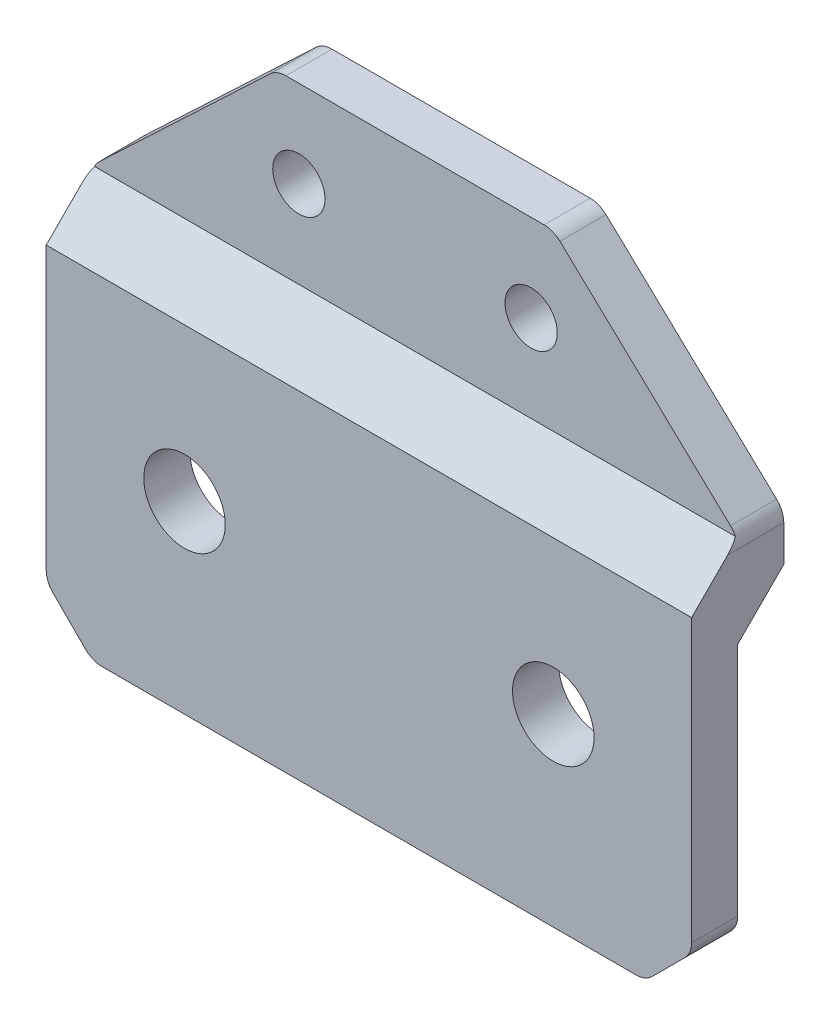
ISO-10303-21;
HEADER;
FILE_DESCRIPTION(('STEP AP214'),'2;1');
FILE_NAME('part.step','',(''),(''),'','','');
FILE_SCHEMA(('AUTOMOTIVE_DESIGN { 1 0 10303 214 1 1 1 1 }'));
ENDSEC;
DATA;
#1=APPLICATION_CONTEXT('core data for automotive mechanical design processes');
#2=APPLICATION_PROTOCOL_DEFINITION('international standard','automotive_design',2000,#1);
#3=PRODUCT_CONTEXT('',#1,'mechanical');
#4=PRODUCT('Part','Part','',(#3));
#5=PRODUCT_RELATED_PRODUCT_CATEGORY('part','',(#4));
#6=PRODUCT_DEFINITION_FORMATION('','',#4);
#7=PRODUCT_DEFINITION_CONTEXT('part definition',#1,'design');
#8=PRODUCT_DEFINITION('design','',#6,#7);
#9=PRODUCT_DEFINITION_SHAPE('','',#8);
#10=(LENGTH_UNIT() NAMED_UNIT(*) SI_UNIT(.MILLI.,.METRE.));
#11=(NAMED_UNIT(*) PLANE_ANGLE_UNIT() SI_UNIT($,.RADIAN.));
#12=(NAMED_UNIT(*) SI_UNIT($,.STERADIAN.) SOLID_ANGLE_UNIT());
#13=UNCERTAINTY_MEASURE_WITH_UNIT(LENGTH_MEASURE(1.E-05),#10,'distance_accuracy_value','');
#14=(GEOMETRIC_REPRESENTATION_CONTEXT(3) GLOBAL_UNCERTAINTY_ASSIGNED_CONTEXT((#13)) GLOBAL_UNIT_ASSIGNED_CONTEXT((#10,
#11,#12)) REPRESENTATION_CONTEXT('',''));
#15=CARTESIAN_POINT('',(0.,0.,0.));
#16=DIRECTION('',(0.,0.,1.));
#17=DIRECTION('',(1.,0.,0.));
#18=AXIS2_PLACEMENT_3D('',#15,#16,#17);
#19=CARTESIAN_POINT('',(22.225,13.7,3.175));
#20=DIRECTION('',(-1.,0.,0.));
#21=DIRECTION('',(0.,0.,1.));
#22=AXIS2_PLACEMENT_3D('',#19,#20,#21);
#23=PLANE('',#22);
#24=DIRECTION('',(0.,-1.,0.));
#25=VECTOR('',#24,1.);
#26=CARTESIAN_POINT('',(22.225,13.7,-3.175));
#27=LINE('',#26,#25);
#28=CARTESIAN_POINT('',(22.225,13.0159312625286,-3.175));
#29=VERTEX_POINT('',#28);
#30=CARTESIAN_POINT('',(22.225,10.5249999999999,-3.175));
#31=VERTEX_POINT('',#30);
#32=EDGE_CURVE('E183',#29,#31,#27,.T.);
#33=ORIENTED_EDGE('',*,*,#32,.F.);
#34=DIRECTION('',(0.,0.,-1.));
#35=VECTOR('',#34,1.);
#36=CARTESIAN_POINT('',(22.225,13.0159312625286,3.175));
#37=LINE('',#36,#35);
#38=CARTESIAN_POINT('',(22.225,13.0159312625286,0.68406873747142));
#39=VERTEX_POINT('',#38);
#40=EDGE_CURVE('E261',#29,#39,#37,.F.);
#41=ORIENTED_EDGE('',*,*,#40,.T.);
#42=DIRECTION('',(0.,-0.707106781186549,0.707106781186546));
#43=VECTOR('',#42,1.);
#44=CARTESIAN_POINT('',(22.225,13.7,0.));
#45=LINE('',#44,#43);
#46=CARTESIAN_POINT('',(22.225,10.525,3.175));
#47=VERTEX_POINT('',#46);
#48=EDGE_CURVE('E211',#39,#47,#45,.T.);
#49=ORIENTED_EDGE('',*,*,#48,.T.);
#50=DIRECTION('',(0.,1.,0.));
#51=VECTOR('',#50,1.);
#52=CARTESIAN_POINT('',(22.225,12.7,3.175));
#53=LINE('',#52,#51);
#54=CARTESIAN_POINT('',(22.225,-8.86743596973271,3.175));
#55=VERTEX_POINT('',#54);
#56=EDGE_CURVE('E304',#55,#47,#53,.T.);
#57=ORIENTED_EDGE('',*,*,#56,.F.);
#58=DIRECTION('',(0.,0.,1.));
#59=VECTOR('',#58,1.);
#60=CARTESIAN_POINT('',(22.225,-8.86743596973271,0.));
#61=LINE('',#60,#59);
#62=CARTESIAN_POINT('',(22.225,-8.86743596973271,0.));
#63=VERTEX_POINT('',#62);
#64=EDGE_CURVE('E258',#55,#63,#61,.F.);
#65=ORIENTED_EDGE('',*,*,#64,.T.);
#66=DIRECTION('',(0.,1.,0.));
#67=VECTOR('',#66,1.);
#68=CARTESIAN_POINT('',(22.225,13.7,0.));
#69=LINE('',#68,#67);
#70=CARTESIAN_POINT('',(22.225,7.34999999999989,0.));
#71=VERTEX_POINT('',#70);
#72=EDGE_CURVE('E194',#63,#71,#69,.T.);
#73=ORIENTED_EDGE('',*,*,#72,.T.);
#74=DIRECTION('',(0.,0.707106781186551,-0.707106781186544));
#75=VECTOR('',#74,1.);
#76=CARTESIAN_POINT('',(22.225,8.93749999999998,-1.58750000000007));
#77=LINE('',#76,#75);
#78=EDGE_CURVE('E199',#71,#31,#77,.T.);
#79=ORIENTED_EDGE('',*,*,#78,.T.);
#80=EDGE_LOOP('',(#33,#41,#49,#57,#65,#73,#79));
#81=FACE_BOUND('',#80,.T.);
#82=ADVANCED_FACE('F33',(#81),#23,.F.);
#83=CARTESIAN_POINT('',(9.52500000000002,25.7,3.175));
#84=DIRECTION('',(-0.686791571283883,-0.726854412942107,0.));
#85=DIRECTION('',(0.726854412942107,-0.686791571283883,0.));
#86=AXIS2_PLACEMENT_3D('',#83,#84,#85);
#87=PLANE('',#86);
#88=DIRECTION('',(-0.726854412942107,0.686791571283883,0.));
#89=VECTOR('',#88,1.);
#90=CARTESIAN_POINT('',(22.225,13.7,-3.175));
#91=LINE('',#90,#89);
#92=CARTESIAN_POINT('',(21.7277816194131,14.1698126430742,-3.175));
#93=VERTEX_POINT('',#92);
#94=CARTESIAN_POINT('',(9.9839130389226,25.2663813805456,-3.175));
#95=VERTEX_POINT('',#94);
#96=EDGE_CURVE('E330',#93,#95,#91,.T.);
#97=ORIENTED_EDGE('',*,*,#96,.T.);
#98=DIRECTION('',(0.,0.,-1.));
#99=VECTOR('',#98,1.);
#100=CARTESIAN_POINT('',(9.9839130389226,25.2663813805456,3.175));
#101=LINE('',#100,#99);
#102=CARTESIAN_POINT('',(9.9839130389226,25.2663813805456,0.));
#103=VERTEX_POINT('',#102);
#104=EDGE_CURVE('E256',#95,#103,#101,.F.);
#105=ORIENTED_EDGE('',*,*,#104,.T.);
#106=DIRECTION('',(-0.726854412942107,0.686791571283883,0.));
#107=VECTOR('',#106,1.);
#108=CARTESIAN_POINT('',(22.225,13.7,0.));
#109=LINE('',#108,#107);
#110=CARTESIAN_POINT('',(21.7277816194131,14.1698126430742,0.));
#111=VERTEX_POINT('',#110);
#112=EDGE_CURVE('E345',#111,#103,#109,.T.);
#113=ORIENTED_EDGE('',*,*,#112,.F.);
#114=DIRECTION('',(0.,0.,-1.));
#115=VECTOR('',#114,1.);
#116=CARTESIAN_POINT('',(21.7277816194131,14.1698126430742,3.175));
#117=LINE('',#116,#115);
#118=EDGE_CURVE('E253',#111,#93,#117,.T.);
#119=ORIENTED_EDGE('',*,*,#118,.T.);
#120=EDGE_LOOP('',(#97,#105,#113,#119));
#121=FACE_BOUND('',#120,.T.);
#122=ADVANCED_FACE('F405',(#121),#87,.F.);
#123=CARTESIAN_POINT('',(-9.52500000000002,25.7,3.175));
#124=DIRECTION('',(0.,-1.,0.));
#125=DIRECTION('',(1.,0.,0.));
#126=AXIS2_PLACEMENT_3D('',#123,#124,#125);
#127=PLANE('',#126);
#128=DIRECTION('',(-1.,0.,0.));
#129=VECTOR('',#128,1.);
#130=CARTESIAN_POINT('',(9.52500000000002,25.7,-3.175));
#131=LINE('',#130,#129);
#132=CARTESIAN_POINT('',(8.89363141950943,25.7,-3.175));
#133=VERTEX_POINT('',#132);
#134=CARTESIAN_POINT('',(-8.89363141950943,25.7,-3.175));
#135=VERTEX_POINT('',#134);
#136=EDGE_CURVE('E326',#133,#135,#131,.T.);
#137=ORIENTED_EDGE('',*,*,#136,.T.);
#138=DIRECTION('',(0.,0.,-1.));
#139=VECTOR('',#138,1.);
#140=CARTESIAN_POINT('',(-8.89363141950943,25.7,3.175));
#141=LINE('',#140,#139);
#142=CARTESIAN_POINT('',(-8.89363141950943,25.7,0.));
#143=VERTEX_POINT('',#142);
#144=EDGE_CURVE('E243',#135,#143,#141,.F.);
#145=ORIENTED_EDGE('',*,*,#144,.T.);
#146=DIRECTION('',(-1.,0.,0.));
#147=VECTOR('',#146,1.);
#148=CARTESIAN_POINT('',(9.52500000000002,25.7,0.));
#149=LINE('',#148,#147);
#150=CARTESIAN_POINT('',(8.89363141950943,25.7,0.));
#151=VERTEX_POINT('',#150);
#152=EDGE_CURVE('E340',#151,#143,#149,.T.);
#153=ORIENTED_EDGE('',*,*,#152,.F.);
#154=DIRECTION('',(0.,0.,-1.));
#155=VECTOR('',#154,1.);
#156=CARTESIAN_POINT('',(8.89363141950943,25.7,3.175));
#157=LINE('',#156,#155);
#158=EDGE_CURVE('E240',#151,#133,#157,.T.);
#159=ORIENTED_EDGE('',*,*,#158,.T.);
#160=EDGE_LOOP('',(#137,#145,#153,#159));
#161=FACE_BOUND('',#160,.T.);
#162=ADVANCED_FACE('F410',(#161),#127,.F.);
#163=CARTESIAN_POINT('',(-22.225,13.7,3.175));
#164=DIRECTION('',(0.686791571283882,-0.726854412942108,0.));
#165=DIRECTION('',(0.726854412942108,0.686791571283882,0.));
#166=AXIS2_PLACEMENT_3D('',#163,#164,#165);
#167=PLANE('',#166);
#168=DIRECTION('',(-0.726854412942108,-0.686791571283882,0.));
#169=VECTOR('',#168,1.);
#170=CARTESIAN_POINT('',(-9.52500000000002,25.7,0.));
#171=LINE('',#170,#169);
#172=CARTESIAN_POINT('',(-9.9839130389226,25.2663813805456,0.));
#173=VERTEX_POINT('',#172);
#174=CARTESIAN_POINT('',(-21.7277816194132,14.1698126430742,0.));
#175=VERTEX_POINT('',#174);
#176=EDGE_CURVE('E351',#173,#175,#171,.T.);
#177=ORIENTED_EDGE('',*,*,#176,.F.);
#178=DIRECTION('',(0.,0.,-1.));
#179=VECTOR('',#178,1.);
#180=CARTESIAN_POINT('',(-9.9839130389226,25.2663813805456,3.175));
#181=LINE('',#180,#179);
#182=CARTESIAN_POINT('',(-9.9839130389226,25.2663813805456,-3.175));
#183=VERTEX_POINT('',#182);
#184=EDGE_CURVE('E229',#173,#183,#181,.T.);
#185=ORIENTED_EDGE('',*,*,#184,.T.);
#186=DIRECTION('',(-0.726854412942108,-0.686791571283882,0.));
#187=VECTOR('',#186,1.);
#188=CARTESIAN_POINT('',(-9.52500000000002,25.7,-3.175));
#189=LINE('',#188,#187);
#190=CARTESIAN_POINT('',(-21.7277816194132,14.1698126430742,-3.175));
#191=VERTEX_POINT('',#190);
#192=EDGE_CURVE('E335',#183,#191,#189,.T.);
#193=ORIENTED_EDGE('',*,*,#192,.T.);
#194=DIRECTION('',(0.,0.,-1.));
#195=VECTOR('',#194,1.);
#196=CARTESIAN_POINT('',(-21.7277816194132,14.1698126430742,3.175));
#197=LINE('',#196,#195);
#198=EDGE_CURVE('E227',#191,#175,#197,.F.);
#199=ORIENTED_EDGE('',*,*,#198,.T.);
#200=EDGE_LOOP('',(#177,#185,#193,#199));
#201=FACE_BOUND('',#200,.T.);
#202=ADVANCED_FACE('F466',(#201),#167,.F.);
#203=CARTESIAN_POINT('',(-22.225,12.7,3.175));
#204=DIRECTION('',(1.,0.,0.));
#205=DIRECTION('',(0.,1.,0.));
#206=AXIS2_PLACEMENT_3D('',#203,#204,#205);
#207=PLANE('',#206);
#208=DIRECTION('',(0.,0.707106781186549,-0.707106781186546));
#209=VECTOR('',#208,1.);
#210=CARTESIAN_POINT('',(-22.225,13.7,0.));
#211=LINE('',#210,#209);
#212=CARTESIAN_POINT('',(-22.225,10.525,3.175));
#213=VERTEX_POINT('',#212);
#214=CARTESIAN_POINT('',(-22.225,13.0159312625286,0.684068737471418));
#215=VERTEX_POINT('',#214);
#216=EDGE_CURVE('E215',#213,#215,#211,.T.);
#217=ORIENTED_EDGE('',*,*,#216,.T.);
#218=DIRECTION('',(0.,0.,-1.));
#219=VECTOR('',#218,1.);
#220=CARTESIAN_POINT('',(-22.225,13.0159312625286,3.175));
#221=LINE('',#220,#219);
#222=CARTESIAN_POINT('',(-22.225,13.0159312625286,-3.175));
#223=VERTEX_POINT('',#222);
#224=EDGE_CURVE('E269',#215,#223,#221,.T.);
#225=ORIENTED_EDGE('',*,*,#224,.T.);
#226=DIRECTION('',(0.,-1.,0.));
#227=VECTOR('',#226,1.);
#228=CARTESIAN_POINT('',(-22.225,0.,-3.175));
#229=LINE('',#228,#227);
#230=CARTESIAN_POINT('',(-22.225,10.5249999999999,-3.175));
#231=VERTEX_POINT('',#230);
#232=EDGE_CURVE('E178',#223,#231,#229,.T.);
#233=ORIENTED_EDGE('',*,*,#232,.T.);
#234=DIRECTION('',(0.,-0.707106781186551,0.707106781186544));
#235=VECTOR('',#234,1.);
#236=CARTESIAN_POINT('',(-22.225,8.43749999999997,-1.08750000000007));
#237=LINE('',#236,#235);
#238=CARTESIAN_POINT('',(-22.225,7.34999999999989,0.));
#239=VERTEX_POINT('',#238);
#240=EDGE_CURVE('E169',#231,#239,#237,.T.);
#241=ORIENTED_EDGE('',*,*,#240,.T.);
#242=DIRECTION('',(0.,-1.,0.));
#243=VECTOR('',#242,1.);
#244=CARTESIAN_POINT('',(-22.225,12.7,0.));
#245=LINE('',#244,#243);
#246=CARTESIAN_POINT('',(-22.225,-8.86743596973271,0.));
#247=VERTEX_POINT('',#246);
#248=EDGE_CURVE('E174',#239,#247,#245,.T.);
#249=ORIENTED_EDGE('',*,*,#248,.T.);
#250=DIRECTION('',(0.,0.,-1.));
#251=VECTOR('',#250,1.);
#252=CARTESIAN_POINT('',(-22.225,-8.86743596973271,3.175));
#253=LINE('',#252,#251);
#254=CARTESIAN_POINT('',(-22.225,-8.86743596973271,3.175));
#255=VERTEX_POINT('',#254);
#256=EDGE_CURVE('E267',#247,#255,#253,.F.);
#257=ORIENTED_EDGE('',*,*,#256,.T.);
#258=DIRECTION('',(0.,-1.,0.));
#259=VECTOR('',#258,1.);
#260=CARTESIAN_POINT('',(-22.225,13.7,3.175));
#261=LINE('',#260,#259);
#262=EDGE_CURVE('E204',#213,#255,#261,.T.);
#263=ORIENTED_EDGE('',*,*,#262,.F.);
#264=EDGE_LOOP('',(#217,#225,#233,#241,#249,#257,#263));
#265=FACE_BOUND('',#264,.T.);
#266=ADVANCED_FACE('F172',(#265),#207,.F.);
#267=CARTESIAN_POINT('',(-22.225,-12.7,3.175));
#268=DIRECTION('',(0.,1.,0.));
#269=DIRECTION('',(0.,0.,1.));
#270=AXIS2_PLACEMENT_3D('',#267,#268,#269);
#271=PLANE('',#270);
#272=DIRECTION('',(1.,0.,0.));
#273=VECTOR('',#272,1.);
#274=CARTESIAN_POINT('',(-22.225,-12.7,0.));
#275=LINE('',#274,#273);
#276=CARTESIAN_POINT('',(-18.3924359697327,-12.7,0.));
#277=VERTEX_POINT('',#276);
#278=CARTESIAN_POINT('',(18.3924359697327,-12.7,0.));
#279=VERTEX_POINT('',#278);
#280=EDGE_CURVE('E193',#277,#279,#275,.T.);
#281=ORIENTED_EDGE('',*,*,#280,.T.);
#282=DIRECTION('',(0.,0.,-1.));
#283=VECTOR('',#282,1.);
#284=CARTESIAN_POINT('',(18.3924359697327,-12.7,3.175));
#285=LINE('',#284,#283);
#286=CARTESIAN_POINT('',(18.3924359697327,-12.7,3.175));
#287=VERTEX_POINT('',#286);
#288=EDGE_CURVE('E274',#279,#287,#285,.F.);
#289=ORIENTED_EDGE('',*,*,#288,.T.);
#290=DIRECTION('',(1.,0.,0.));
#291=VECTOR('',#290,1.);
#292=CARTESIAN_POINT('',(-22.225,-12.7,3.175));
#293=LINE('',#292,#291);
#294=CARTESIAN_POINT('',(-18.3924359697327,-12.7,3.175));
#295=VERTEX_POINT('',#294);
#296=EDGE_CURVE('E200',#295,#287,#293,.T.);
#297=ORIENTED_EDGE('',*,*,#296,.F.);
#298=DIRECTION('',(0.,0.,1.));
#299=VECTOR('',#298,1.);
#300=CARTESIAN_POINT('',(-18.3924359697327,-12.7,0.));
#301=LINE('',#300,#299);
#302=EDGE_CURVE('E271',#295,#277,#301,.F.);
#303=ORIENTED_EDGE('',*,*,#302,.T.);
#304=EDGE_LOOP('',(#281,#289,#297,#303));
#305=FACE_BOUND('',#304,.T.);
#306=ADVANCED_FACE('F301',(#305),#271,.F.);
#307=CARTESIAN_POINT('',(0.,0.,3.175));
#308=DIRECTION('',(0.,0.,1.));
#309=DIRECTION('',(1.,0.,0.));
#310=AXIS2_PLACEMENT_3D('',#307,#308,#309);
#311=PLANE('',#310);
#312=CARTESIAN_POINT('',(-12.7,0.,3.175));
#313=DIRECTION('',(0.,0.,1.));
#314=DIRECTION('',(1.,0.,0.));
#315=AXIS2_PLACEMENT_3D('',#312,#313,#314);
#316=CIRCLE('',#315,2.8067);
#317=CARTESIAN_POINT('',(-9.89330000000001,0.,3.175));
#318=VERTEX_POINT('',#317);
#319=EDGE_CURVE('E375',#318,#318,#316,.T.);
#320=ORIENTED_EDGE('',*,*,#319,.F.);
#321=EDGE_LOOP('',(#320));
#322=FACE_BOUND('',#321,.T.);
#323=CARTESIAN_POINT('',(12.7,0.,3.175));
#324=DIRECTION('',(0.,0.,1.));
#325=DIRECTION('',(1.,0.,0.));
#326=AXIS2_PLACEMENT_3D('',#323,#324,#325);
#327=CIRCLE('',#326,2.8067);
#328=CARTESIAN_POINT('',(15.5067,0.,3.175));
#329=VERTEX_POINT('',#328);
#330=EDGE_CURVE('E369',#329,#329,#327,.T.);
#331=ORIENTED_EDGE('',*,*,#330,.F.);
#332=EDGE_LOOP('',(#331));
#333=FACE_BOUND('',#332,.T.);
#334=ORIENTED_EDGE('',*,*,#296,.T.);
#335=CARTESIAN_POINT('',(18.3924359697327,-11.1125,3.175));
#336=DIRECTION('',(0.,0.,1.));
#337=DIRECTION('',(1.,0.,0.));
#338=AXIS2_PLACEMENT_3D('',#335,#336,#337);
#339=CIRCLE('',#338,1.5875);
#340=CARTESIAN_POINT('',(19.5149679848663,-12.2350320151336,3.175));
#341=VERTEX_POINT('',#340);
#342=EDGE_CURVE('E283',#287,#341,#339,.T.);
#343=ORIENTED_EDGE('',*,*,#342,.T.);
#344=DIRECTION('',(-0.707106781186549,-0.707106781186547,0.));
#345=VECTOR('',#344,1.);
#346=CARTESIAN_POINT('',(15.875,-15.875,3.175));
#347=LINE('',#346,#345);
#348=CARTESIAN_POINT('',(21.7600320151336,-9.98996798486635,3.175));
#349=VERTEX_POINT('',#348);
#350=EDGE_CURVE('E221',#341,#349,#347,.F.);
#351=ORIENTED_EDGE('',*,*,#350,.T.);
#352=CARTESIAN_POINT('',(20.6375,-8.86743596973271,3.175));
#353=DIRECTION('',(0.,0.,1.));
#354=DIRECTION('',(1.,0.,0.));
#355=AXIS2_PLACEMENT_3D('',#352,#353,#354);
#356=CIRCLE('',#355,1.5875);
#357=EDGE_CURVE('E281',#349,#55,#356,.T.);
#358=ORIENTED_EDGE('',*,*,#357,.T.);
#359=ORIENTED_EDGE('',*,*,#56,.T.);
#360=DIRECTION('',(-1.,0.,0.));
#361=VECTOR('',#360,1.);
#362=CARTESIAN_POINT('',(-22.225,10.525,3.175));
#363=LINE('',#362,#361);
#364=EDGE_CURVE('E213',#47,#213,#363,.T.);
#365=ORIENTED_EDGE('',*,*,#364,.T.);
#366=ORIENTED_EDGE('',*,*,#262,.T.);
#367=CARTESIAN_POINT('',(-20.6375,-8.86743596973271,3.175));
#368=DIRECTION('',(0.,0.,1.));
#369=DIRECTION('',(1.,0.,0.));
#370=AXIS2_PLACEMENT_3D('',#367,#368,#369);
#371=CIRCLE('',#370,1.5875);
#372=CARTESIAN_POINT('',(-21.7600320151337,-9.98996798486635,3.175));
#373=VERTEX_POINT('',#372);
#374=EDGE_CURVE('E277',#255,#373,#371,.T.);
#375=ORIENTED_EDGE('',*,*,#374,.T.);
#376=DIRECTION('',(-0.707106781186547,0.707106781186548,0.));
#377=VECTOR('',#376,1.);
#378=CARTESIAN_POINT('',(-15.875,-15.875,3.175));
#379=LINE('',#378,#377);
#380=CARTESIAN_POINT('',(-19.5149679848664,-12.2350320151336,3.175));
#381=VERTEX_POINT('',#380);
#382=EDGE_CURVE('E224',#373,#381,#379,.F.);
#383=ORIENTED_EDGE('',*,*,#382,.T.);
#384=CARTESIAN_POINT('',(-18.3924359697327,-11.1125,3.175));
#385=DIRECTION('',(0.,0.,1.));
#386=DIRECTION('',(1.,0.,0.));
#387=AXIS2_PLACEMENT_3D('',#384,#385,#386);
#388=CIRCLE('',#387,1.5875);
#389=EDGE_CURVE('E279',#381,#295,#388,.T.);
#390=ORIENTED_EDGE('',*,*,#389,.T.);
#391=EDGE_LOOP('',(#334,#343,#351,#358,#359,#365,#366,#375,#383,#390));
#392=FACE_BOUND('',#391,.T.);
#393=ADVANCED_FACE('F308',(#322,#333,#392),#311,.T.);
#394=CARTESIAN_POINT('',(0.,0.,0.));
#395=DIRECTION('',(0.,0.,1.));
#396=DIRECTION('',(1.,0.,0.));
#397=AXIS2_PLACEMENT_3D('',#394,#395,#396);
#398=PLANE('',#397);
#399=CARTESIAN_POINT('',(-12.7,0.,0.));
#400=DIRECTION('',(0.,0.,1.));
#401=DIRECTION('',(1.,0.,0.));
#402=AXIS2_PLACEMENT_3D('',#399,#400,#401);
#403=CIRCLE('',#402,2.8067);
#404=CARTESIAN_POINT('',(-9.89330000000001,0.,0.));
#405=VERTEX_POINT('',#404);
#406=EDGE_CURVE('E372',#405,#405,#403,.T.);
#407=ORIENTED_EDGE('',*,*,#406,.T.);
#408=EDGE_LOOP('',(#407));
#409=FACE_BOUND('',#408,.T.);
#410=CARTESIAN_POINT('',(12.7,0.,0.));
#411=DIRECTION('',(0.,0.,1.));
#412=DIRECTION('',(1.,0.,0.));
#413=AXIS2_PLACEMENT_3D('',#410,#411,#412);
#414=CIRCLE('',#413,2.8067);
#415=CARTESIAN_POINT('',(15.5067,0.,0.));
#416=VERTEX_POINT('',#415);
#417=EDGE_CURVE('E366',#416,#416,#414,.T.);
#418=ORIENTED_EDGE('',*,*,#417,.T.);
#419=EDGE_LOOP('',(#418));
#420=FACE_BOUND('',#419,.T.);
#421=DIRECTION('',(0.707106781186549,0.707106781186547,0.));
#422=VECTOR('',#421,1.);
#423=CARTESIAN_POINT('',(22.225,-9.525,0.));
#424=LINE('',#423,#422);
#425=CARTESIAN_POINT('',(21.7600320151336,-9.98996798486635,0.));
#426=VERTEX_POINT('',#425);
#427=CARTESIAN_POINT('',(19.5149679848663,-12.2350320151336,0.));
#428=VERTEX_POINT('',#427);
#429=EDGE_CURVE('E217',#426,#428,#424,.F.);
#430=ORIENTED_EDGE('',*,*,#429,.T.);
#431=CARTESIAN_POINT('',(18.3924359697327,-11.1125,0.));
#432=DIRECTION('',(0.,0.,1.));
#433=DIRECTION('',(1.,0.,0.));
#434=AXIS2_PLACEMENT_3D('',#431,#432,#433);
#435=CIRCLE('',#434,1.5875);
#436=EDGE_CURVE('E293',#428,#279,#435,.F.);
#437=ORIENTED_EDGE('',*,*,#436,.T.);
#438=ORIENTED_EDGE('',*,*,#280,.F.);
#439=CARTESIAN_POINT('',(-18.3924359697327,-11.1125,0.));
#440=DIRECTION('',(0.,0.,1.));
#441=DIRECTION('',(1.,0.,0.));
#442=AXIS2_PLACEMENT_3D('',#439,#440,#441);
#443=CIRCLE('',#442,1.5875);
#444=CARTESIAN_POINT('',(-19.5149679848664,-12.2350320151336,0.));
#445=VERTEX_POINT('',#444);
#446=EDGE_CURVE('E54',#277,#445,#443,.F.);
#447=ORIENTED_EDGE('',*,*,#446,.T.);
#448=DIRECTION('',(0.707106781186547,-0.707106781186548,0.));
#449=VECTOR('',#448,1.);
#450=CARTESIAN_POINT('',(-19.05,-12.7,0.));
#451=LINE('',#450,#449);
#452=CARTESIAN_POINT('',(-21.7600320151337,-9.98996798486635,0.));
#453=VERTEX_POINT('',#452);
#454=EDGE_CURVE('E219',#445,#453,#451,.F.);
#455=ORIENTED_EDGE('',*,*,#454,.T.);
#456=CARTESIAN_POINT('',(-20.6375,-8.86743596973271,0.));
#457=DIRECTION('',(0.,0.,1.));
#458=DIRECTION('',(1.,0.,0.));
#459=AXIS2_PLACEMENT_3D('',#456,#457,#458);
#460=CIRCLE('',#459,1.5875);
#461=EDGE_CURVE('E192',#453,#247,#460,.F.);
#462=ORIENTED_EDGE('',*,*,#461,.T.);
#463=ORIENTED_EDGE('',*,*,#248,.F.);
#464=DIRECTION('',(1.,0.,0.));
#465=VECTOR('',#464,1.);
#466=CARTESIAN_POINT('',(0.,7.34999999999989,0.));
#467=LINE('',#466,#465);
#468=EDGE_CURVE('E190',#239,#71,#467,.T.);
#469=ORIENTED_EDGE('',*,*,#468,.T.);
#470=ORIENTED_EDGE('',*,*,#72,.F.);
#471=CARTESIAN_POINT('',(20.6375,-8.86743596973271,0.));
#472=DIRECTION('',(0.,0.,1.));
#473=DIRECTION('',(1.,0.,0.));
#474=AXIS2_PLACEMENT_3D('',#471,#472,#473);
#475=CIRCLE('',#474,1.5875);
#476=EDGE_CURVE('E291',#63,#426,#475,.F.);
#477=ORIENTED_EDGE('',*,*,#476,.T.);
#478=EDGE_LOOP('',(#430,#437,#438,#447,#455,#462,#463,#469,#470,#477));
#479=FACE_BOUND('',#478,.T.);
#480=ADVANCED_FACE('F188',(#409,#420,#479),#398,.F.);
#481=CARTESIAN_POINT('',(0.,0.,-3.175));
#482=DIRECTION('',(0.,0.,-1.));
#483=DIRECTION('',(-1.,0.,0.));
#484=AXIS2_PLACEMENT_3D('',#481,#482,#483);
#485=PLANE('',#484);
#486=CARTESIAN_POINT('',(7.99999999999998,19.7,-3.175));
#487=DIRECTION('',(0.,0.,-1.));
#488=DIRECTION('',(-1.,0.,0.));
#489=AXIS2_PLACEMENT_3D('',#486,#487,#488);
#490=CIRCLE('',#489,1.8);
#491=CARTESIAN_POINT('',(6.19999999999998,19.7,-3.175));
#492=VERTEX_POINT('',#491);
#493=EDGE_CURVE('E363',#492,#492,#490,.T.);
#494=ORIENTED_EDGE('',*,*,#493,.F.);
#495=EDGE_LOOP('',(#494));
#496=FACE_BOUND('',#495,.T.);
#497=CARTESIAN_POINT('',(-8.00000000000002,19.7,-3.175));
#498=DIRECTION('',(0.,0.,-1.));
#499=DIRECTION('',(-1.,0.,0.));
#500=AXIS2_PLACEMENT_3D('',#497,#498,#499);
#501=CIRCLE('',#500,1.8);
#502=CARTESIAN_POINT('',(-9.80000000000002,19.7,-3.175));
#503=VERTEX_POINT('',#502);
#504=EDGE_CURVE('E357',#503,#503,#501,.T.);
#505=ORIENTED_EDGE('',*,*,#504,.F.);
#506=EDGE_LOOP('',(#505));
#507=FACE_BOUND('',#506,.T.);
#508=ORIENTED_EDGE('',*,*,#192,.F.);
#509=CARTESIAN_POINT('',(-8.89363141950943,24.1125,-3.175));
#510=DIRECTION('',(0.,0.,-1.));
#511=DIRECTION('',(-1.,0.,0.));
#512=AXIS2_PLACEMENT_3D('',#509,#510,#511);
#513=CIRCLE('',#512,1.5875);
#514=EDGE_CURVE('E238',#183,#135,#513,.T.);
#515=ORIENTED_EDGE('',*,*,#514,.T.);
#516=ORIENTED_EDGE('',*,*,#136,.F.);
#517=CARTESIAN_POINT('',(8.89363141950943,24.1125,-3.175));
#518=DIRECTION('',(0.,0.,-1.));
#519=DIRECTION('',(-1.,0.,0.));
#520=AXIS2_PLACEMENT_3D('',#517,#518,#519);
#521=CIRCLE('',#520,1.5875);
#522=EDGE_CURVE('E236',#133,#95,#521,.T.);
#523=ORIENTED_EDGE('',*,*,#522,.T.);
#524=ORIENTED_EDGE('',*,*,#96,.F.);
#525=CARTESIAN_POINT('',(20.6375,13.0159312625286,-3.175));
#526=DIRECTION('',(0.,0.,-1.));
#527=DIRECTION('',(-1.,0.,0.));
#528=AXIS2_PLACEMENT_3D('',#525,#526,#527);
#529=CIRCLE('',#528,1.5875);
#530=EDGE_CURVE('E234',#93,#29,#529,.T.);
#531=ORIENTED_EDGE('',*,*,#530,.T.);
#532=ORIENTED_EDGE('',*,*,#32,.T.);
#533=DIRECTION('',(-1.,0.,0.));
#534=VECTOR('',#533,1.);
#535=CARTESIAN_POINT('',(0.,10.5249999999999,-3.175));
#536=LINE('',#535,#534);
#537=EDGE_CURVE('E184',#31,#231,#536,.T.);
#538=ORIENTED_EDGE('',*,*,#537,.T.);
#539=ORIENTED_EDGE('',*,*,#232,.F.);
#540=CARTESIAN_POINT('',(-20.6375,13.0159312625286,-3.175));
#541=DIRECTION('',(0.,0.,-1.));
#542=DIRECTION('',(-1.,0.,0.));
#543=AXIS2_PLACEMENT_3D('',#540,#541,#542);
#544=CIRCLE('',#543,1.5875);
#545=EDGE_CURVE('E232',#223,#191,#544,.T.);
#546=ORIENTED_EDGE('',*,*,#545,.T.);
#547=EDGE_LOOP('',(#508,#515,#516,#523,#524,#531,#532,#538,#539,#546));
#548=FACE_BOUND('',#547,.T.);
#549=ADVANCED_FACE('F395',(#496,#507,#548),#485,.T.);
#550=CARTESIAN_POINT('',(0.,7.34999999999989,0.));
#551=DIRECTION('',(0.,0.707106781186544,0.707106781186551));
#552=DIRECTION('',(1.,0.,0.));
#553=AXIS2_PLACEMENT_3D('',#550,#551,#552);
#554=PLANE('',#553);
#555=ORIENTED_EDGE('',*,*,#240,.F.);
#556=ORIENTED_EDGE('',*,*,#537,.F.);
#557=ORIENTED_EDGE('',*,*,#78,.F.);
#558=ORIENTED_EDGE('',*,*,#468,.F.);
#559=EDGE_LOOP('',(#555,#556,#557,#558));
#560=FACE_BOUND('',#559,.T.);
#561=ADVANCED_FACE('F197',(#560),#554,.F.);
#562=CARTESIAN_POINT('',(0.,0.,0.));
#563=DIRECTION('',(0.,0.,-1.));
#564=DIRECTION('',(-1.,0.,0.));
#565=AXIS2_PLACEMENT_3D('',#562,#563,#564);
#566=PLANE('',#565);
#567=CARTESIAN_POINT('',(7.99999999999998,19.7,0.));
#568=DIRECTION('',(0.,0.,-1.));
#569=DIRECTION('',(-1.,0.,0.));
#570=AXIS2_PLACEMENT_3D('',#567,#568,#569);
#571=CIRCLE('',#570,1.8);
#572=CARTESIAN_POINT('',(6.19999999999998,19.7,0.));
#573=VERTEX_POINT('',#572);
#574=EDGE_CURVE('E360',#573,#573,#571,.T.);
#575=ORIENTED_EDGE('',*,*,#574,.T.);
#576=EDGE_LOOP('',(#575));
#577=FACE_BOUND('',#576,.T.);
#578=CARTESIAN_POINT('',(-8.00000000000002,19.7,0.));
#579=DIRECTION('',(0.,0.,-1.));
#580=DIRECTION('',(-1.,0.,0.));
#581=AXIS2_PLACEMENT_3D('',#578,#579,#580);
#582=CIRCLE('',#581,1.8);
#583=CARTESIAN_POINT('',(-9.80000000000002,19.7,0.));
#584=VERTEX_POINT('',#583);
#585=EDGE_CURVE('E354',#584,#584,#582,.T.);
#586=ORIENTED_EDGE('',*,*,#585,.T.);
#587=EDGE_LOOP('',(#586));
#588=FACE_BOUND('',#587,.T.);
#589=ORIENTED_EDGE('',*,*,#152,.T.);
#590=CARTESIAN_POINT('',(-8.89363141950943,24.1125,0.));
#591=DIRECTION('',(0.,0.,-1.));
#592=DIRECTION('',(-1.,0.,0.));
#593=AXIS2_PLACEMENT_3D('',#590,#591,#592);
#594=CIRCLE('',#593,1.5875);
#595=EDGE_CURVE('E251',#143,#173,#594,.F.);
#596=ORIENTED_EDGE('',*,*,#595,.T.);
#597=ORIENTED_EDGE('',*,*,#176,.T.);
#598=CARTESIAN_POINT('',(-20.6375,13.0159312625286,0.));
#599=DIRECTION('',(0.,0.,-1.));
#600=DIRECTION('',(-1.,0.,0.));
#601=AXIS2_PLACEMENT_3D('',#598,#599,#600);
#602=CIRCLE('',#601,1.5875);
#603=CARTESIAN_POINT('',(-22.0700523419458,13.7,0.));
#604=VERTEX_POINT('',#603);
#605=EDGE_CURVE('E245',#175,#604,#602,.F.);
#606=ORIENTED_EDGE('',*,*,#605,.T.);
#607=DIRECTION('',(1.,0.,0.));
#608=VECTOR('',#607,1.);
#609=CARTESIAN_POINT('',(-22.225,13.7,0.));
#610=LINE('',#609,#608);
#611=CARTESIAN_POINT('',(22.0700523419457,13.7,0.));
#612=VERTEX_POINT('',#611);
#613=EDGE_CURVE('E348',#604,#612,#610,.T.);
#614=ORIENTED_EDGE('',*,*,#613,.T.);
#615=CARTESIAN_POINT('',(20.6375,13.0159312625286,0.));
#616=DIRECTION('',(0.,0.,-1.));
#617=DIRECTION('',(-1.,0.,0.));
#618=AXIS2_PLACEMENT_3D('',#615,#616,#617);
#619=CIRCLE('',#618,1.5875);
#620=EDGE_CURVE('E247',#612,#111,#619,.F.);
#621=ORIENTED_EDGE('',*,*,#620,.T.);
#622=ORIENTED_EDGE('',*,*,#112,.T.);
#623=CARTESIAN_POINT('',(8.89363141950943,24.1125,0.));
#624=DIRECTION('',(0.,0.,-1.));
#625=DIRECTION('',(-1.,0.,0.));
#626=AXIS2_PLACEMENT_3D('',#623,#624,#625);
#627=CIRCLE('',#626,1.5875);
#628=EDGE_CURVE('E249',#103,#151,#627,.F.);
#629=ORIENTED_EDGE('',*,*,#628,.T.);
#630=EDGE_LOOP('',(#589,#596,#597,#606,#614,#621,#622,#629));
#631=FACE_BOUND('',#630,.T.);
#632=ADVANCED_FACE('F416',(#577,#588,#631),#566,.F.);
#633=CARTESIAN_POINT('',(-8.00000000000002,19.7,-3.175));
#634=DIRECTION('',(0.,0.,-1.));
#635=DIRECTION('',(-1.,0.,0.));
#636=AXIS2_PLACEMENT_3D('',#633,#634,#635);
#637=CYLINDRICAL_SURFACE('',#636,1.8);
#638=ORIENTED_EDGE('',*,*,#504,.T.);
#639=EDGE_LOOP('',(#638));
#640=FACE_BOUND('',#639,.T.);
#641=ORIENTED_EDGE('',*,*,#585,.F.);
#642=EDGE_LOOP('',(#641));
#643=FACE_BOUND('',#642,.T.);
#644=ADVANCED_FACE('F478',(#640,#643),#637,.F.);
#645=CARTESIAN_POINT('',(7.99999999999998,19.7,-3.175));
#646=DIRECTION('',(0.,0.,-1.));
#647=DIRECTION('',(-1.,0.,0.));
#648=AXIS2_PLACEMENT_3D('',#645,#646,#647);
#649=CYLINDRICAL_SURFACE('',#648,1.8);
#650=ORIENTED_EDGE('',*,*,#493,.T.);
#651=EDGE_LOOP('',(#650));
#652=FACE_BOUND('',#651,.T.);
#653=ORIENTED_EDGE('',*,*,#574,.F.);
#654=EDGE_LOOP('',(#653));
#655=FACE_BOUND('',#654,.T.);
#656=ADVANCED_FACE('F390',(#652,#655),#649,.F.);
#657=CARTESIAN_POINT('',(12.7,0.,3.175));
#658=DIRECTION('',(0.,0.,1.));
#659=DIRECTION('',(1.,0.,0.));
#660=AXIS2_PLACEMENT_3D('',#657,#658,#659);
#661=CYLINDRICAL_SURFACE('',#660,2.8067);
#662=ORIENTED_EDGE('',*,*,#330,.T.);
#663=EDGE_LOOP('',(#662));
#664=FACE_BOUND('',#663,.T.);
#665=ORIENTED_EDGE('',*,*,#417,.F.);
#666=EDGE_LOOP('',(#665));
#667=FACE_BOUND('',#666,.T.);
#668=ADVANCED_FACE('F387',(#664,#667),#661,.F.);
#669=CARTESIAN_POINT('',(-12.7,0.,3.175));
#670=DIRECTION('',(0.,0.,1.));
#671=DIRECTION('',(1.,0.,0.));
#672=AXIS2_PLACEMENT_3D('',#669,#670,#671);
#673=CYLINDRICAL_SURFACE('',#672,2.8067);
#674=ORIENTED_EDGE('',*,*,#319,.T.);
#675=EDGE_LOOP('',(#674));
#676=FACE_BOUND('',#675,.T.);
#677=ORIENTED_EDGE('',*,*,#406,.F.);
#678=EDGE_LOOP('',(#677));
#679=FACE_BOUND('',#678,.T.);
#680=ADVANCED_FACE('F379',(#676,#679),#673,.F.);
#681=CARTESIAN_POINT('',(-22.225,13.7,0.));
#682=DIRECTION('',(0.,0.707106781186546,0.707106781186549));
#683=DIRECTION('',(-1.,0.,0.));
#684=AXIS2_PLACEMENT_3D('',#681,#682,#683);
#685=PLANE('',#684);
#686=ORIENTED_EDGE('',*,*,#48,.F.);
#687=CARTESIAN_POINT('',(20.6375,13.0159312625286,0.68406873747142));
#688=DIRECTION('',(0.,0.707106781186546,0.707106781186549));
#689=DIRECTION('',(0.,0.707106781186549,-0.707106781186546));
#690=AXIS2_PLACEMENT_3D('',#687,#688,#689);
#691=ELLIPSE('',#690,2.24506403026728,1.5875);
#692=EDGE_CURVE('E265',#39,#612,#691,.T.);
#693=ORIENTED_EDGE('',*,*,#692,.T.);
#694=ORIENTED_EDGE('',*,*,#613,.F.);
#695=CARTESIAN_POINT('',(-20.6375,13.0159312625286,0.684068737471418));
#696=DIRECTION('',(0.,0.707106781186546,0.707106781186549));
#697=DIRECTION('',(0.,0.707106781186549,-0.707106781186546));
#698=AXIS2_PLACEMENT_3D('',#695,#696,#697);
#699=ELLIPSE('',#698,2.24506403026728,1.5875);
#700=EDGE_CURVE('E263',#604,#215,#699,.T.);
#701=ORIENTED_EDGE('',*,*,#700,.T.);
#702=ORIENTED_EDGE('',*,*,#216,.F.);
#703=ORIENTED_EDGE('',*,*,#364,.F.);
#704=EDGE_LOOP('',(#686,#693,#694,#701,#702,#703));
#705=FACE_BOUND('',#704,.T.);
#706=ADVANCED_FACE('F417',(#705),#685,.T.);
#707=CARTESIAN_POINT('',(-19.05,-12.7,3.175));
#708=DIRECTION('',(0.707106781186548,0.707106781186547,0.));
#709=DIRECTION('',(0.,0.,-1.));
#710=AXIS2_PLACEMENT_3D('',#707,#708,#709);
#711=PLANE('',#710);
#712=ORIENTED_EDGE('',*,*,#454,.F.);
#713=DIRECTION('',(0.,0.,-1.));
#714=VECTOR('',#713,1.);
#715=CARTESIAN_POINT('',(-19.5149679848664,-12.2350320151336,3.175));
#716=LINE('',#715,#714);
#717=EDGE_CURVE('E11',#445,#381,#716,.F.);
#718=ORIENTED_EDGE('',*,*,#717,.T.);
#719=ORIENTED_EDGE('',*,*,#382,.F.);
#720=DIRECTION('',(0.,0.,1.));
#721=VECTOR('',#720,1.);
#722=CARTESIAN_POINT('',(-21.7600320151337,-9.98996798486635,0.));
#723=LINE('',#722,#721);
#724=EDGE_CURVE('E41',#373,#453,#723,.F.);
#725=ORIENTED_EDGE('',*,*,#724,.T.);
#726=EDGE_LOOP('',(#712,#718,#719,#725));
#727=FACE_BOUND('',#726,.T.);
#728=ADVANCED_FACE('F420',(#727),#711,.F.);
#729=CARTESIAN_POINT('',(22.225,-9.525,3.175));
#730=DIRECTION('',(-0.707106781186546,0.707106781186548,0.));
#731=DIRECTION('',(0.,0.,-1.));
#732=AXIS2_PLACEMENT_3D('',#729,#730,#731);
#733=PLANE('',#732);
#734=ORIENTED_EDGE('',*,*,#350,.F.);
#735=DIRECTION('',(0.,0.,1.));
#736=VECTOR('',#735,1.);
#737=CARTESIAN_POINT('',(19.5149679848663,-12.2350320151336,0.));
#738=LINE('',#737,#736);
#739=EDGE_CURVE('E287',#341,#428,#738,.F.);
#740=ORIENTED_EDGE('',*,*,#739,.T.);
#741=ORIENTED_EDGE('',*,*,#429,.F.);
#742=DIRECTION('',(0.,0.,-1.));
#743=VECTOR('',#742,1.);
#744=CARTESIAN_POINT('',(21.7600320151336,-9.98996798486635,3.175));
#745=LINE('',#744,#743);
#746=EDGE_CURVE('E285',#426,#349,#745,.F.);
#747=ORIENTED_EDGE('',*,*,#746,.T.);
#748=EDGE_LOOP('',(#734,#740,#741,#747));
#749=FACE_BOUND('',#748,.T.);
#750=ADVANCED_FACE('F311',(#749),#733,.F.);
#751=CARTESIAN_POINT('',(-8.89363141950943,24.1125,3.175));
#752=DIRECTION('',(0.,0.,-1.));
#753=DIRECTION('',(-1.,0.,0.));
#754=AXIS2_PLACEMENT_3D('',#751,#752,#753);
#755=CYLINDRICAL_SURFACE('',#754,1.5875);
#756=ORIENTED_EDGE('',*,*,#595,.F.);
#757=ORIENTED_EDGE('',*,*,#144,.F.);
#758=ORIENTED_EDGE('',*,*,#514,.F.);
#759=ORIENTED_EDGE('',*,*,#184,.F.);
#760=EDGE_LOOP('',(#756,#757,#758,#759));
#761=FACE_BOUND('',#760,.T.);
#762=ADVANCED_FACE('F426',(#761),#755,.T.);
#763=CARTESIAN_POINT('',(8.89363141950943,24.1125,3.175));
#764=DIRECTION('',(0.,0.,-1.));
#765=DIRECTION('',(-1.,0.,0.));
#766=AXIS2_PLACEMENT_3D('',#763,#764,#765);
#767=CYLINDRICAL_SURFACE('',#766,1.5875);
#768=ORIENTED_EDGE('',*,*,#628,.F.);
#769=ORIENTED_EDGE('',*,*,#104,.F.);
#770=ORIENTED_EDGE('',*,*,#522,.F.);
#771=ORIENTED_EDGE('',*,*,#158,.F.);
#772=EDGE_LOOP('',(#768,#769,#770,#771));
#773=FACE_BOUND('',#772,.T.);
#774=ADVANCED_FACE('F429',(#773),#767,.T.);
#775=CARTESIAN_POINT('',(20.6375,13.0159312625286,3.175));
#776=DIRECTION('',(0.,0.,-1.));
#777=DIRECTION('',(-1.,0.,0.));
#778=AXIS2_PLACEMENT_3D('',#775,#776,#777);
#779=CYLINDRICAL_SURFACE('',#778,1.5875);
#780=ORIENTED_EDGE('',*,*,#692,.F.);
#781=ORIENTED_EDGE('',*,*,#40,.F.);
#782=ORIENTED_EDGE('',*,*,#530,.F.);
#783=ORIENTED_EDGE('',*,*,#118,.F.);
#784=ORIENTED_EDGE('',*,*,#620,.F.);
#785=EDGE_LOOP('',(#780,#781,#782,#783,#784));
#786=FACE_BOUND('',#785,.T.);
#787=ADVANCED_FACE('F433',(#786),#779,.T.);
#788=CARTESIAN_POINT('',(-20.6375,13.0159312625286,3.175));
#789=DIRECTION('',(0.,0.,-1.));
#790=DIRECTION('',(-1.,0.,0.));
#791=AXIS2_PLACEMENT_3D('',#788,#789,#790);
#792=CYLINDRICAL_SURFACE('',#791,1.5875);
#793=ORIENTED_EDGE('',*,*,#605,.F.);
#794=ORIENTED_EDGE('',*,*,#198,.F.);
#795=ORIENTED_EDGE('',*,*,#545,.F.);
#796=ORIENTED_EDGE('',*,*,#224,.F.);
#797=ORIENTED_EDGE('',*,*,#700,.F.);
#798=EDGE_LOOP('',(#793,#794,#795,#796,#797));
#799=FACE_BOUND('',#798,.T.);
#800=ADVANCED_FACE('F437',(#799),#792,.T.);
#801=CARTESIAN_POINT('',(18.3924359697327,-11.1125,3.175));
#802=DIRECTION('',(0.,0.,1.));
#803=DIRECTION('',(1.,0.,0.));
#804=AXIS2_PLACEMENT_3D('',#801,#802,#803);
#805=CYLINDRICAL_SURFACE('',#804,1.5875);
#806=ORIENTED_EDGE('',*,*,#436,.F.);
#807=ORIENTED_EDGE('',*,*,#739,.F.);
#808=ORIENTED_EDGE('',*,*,#342,.F.);
#809=ORIENTED_EDGE('',*,*,#288,.F.);
#810=EDGE_LOOP('',(#806,#807,#808,#809));
#811=FACE_BOUND('',#810,.T.);
#812=ADVANCED_FACE('F305',(#811),#805,.T.);
#813=CARTESIAN_POINT('',(20.6375,-8.86743596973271,3.175));
#814=DIRECTION('',(0.,0.,-1.));
#815=DIRECTION('',(-1.,0.,0.));
#816=AXIS2_PLACEMENT_3D('',#813,#814,#815);
#817=CYLINDRICAL_SURFACE('',#816,1.5875);
#818=ORIENTED_EDGE('',*,*,#357,.F.);
#819=ORIENTED_EDGE('',*,*,#746,.F.);
#820=ORIENTED_EDGE('',*,*,#476,.F.);
#821=ORIENTED_EDGE('',*,*,#64,.F.);
#822=EDGE_LOOP('',(#818,#819,#820,#821));
#823=FACE_BOUND('',#822,.T.);
#824=ADVANCED_FACE('F314',(#823),#817,.T.);
#825=CARTESIAN_POINT('',(-18.3924359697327,-11.1125,3.175));
#826=DIRECTION('',(0.,0.,-1.));
#827=DIRECTION('',(-1.,0.,0.));
#828=AXIS2_PLACEMENT_3D('',#825,#826,#827);
#829=CYLINDRICAL_SURFACE('',#828,1.5875);
#830=ORIENTED_EDGE('',*,*,#389,.F.);
#831=ORIENTED_EDGE('',*,*,#717,.F.);
#832=ORIENTED_EDGE('',*,*,#446,.F.);
#833=ORIENTED_EDGE('',*,*,#302,.F.);
#834=EDGE_LOOP('',(#830,#831,#832,#833));
#835=FACE_BOUND('',#834,.T.);
#836=ADVANCED_FACE('F445',(#835),#829,.T.);
#837=CARTESIAN_POINT('',(-20.6375,-8.86743596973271,3.175));
#838=DIRECTION('',(0.,0.,1.));
#839=DIRECTION('',(1.,0.,0.));
#840=AXIS2_PLACEMENT_3D('',#837,#838,#839);
#841=CYLINDRICAL_SURFACE('',#840,1.5875);
#842=ORIENTED_EDGE('',*,*,#461,.F.);
#843=ORIENTED_EDGE('',*,*,#724,.F.);
#844=ORIENTED_EDGE('',*,*,#374,.F.);
#845=ORIENTED_EDGE('',*,*,#256,.F.);
#846=EDGE_LOOP('',(#842,#843,#844,#845));
#847=FACE_BOUND('',#846,.T.);
#848=ADVANCED_FACE('F35',(#847),#841,.T.);
#849=CLOSED_SHELL('',(#82,#122,#162,#202,#266,#306,#393,#480,#549,#561,#632,#644,#656,#668,#680,
#706,#728,#750,#762,#774,#787,#800,#812,#824,#836,#848));
#850=MANIFOLD_SOLID_BREP('B2',#849);
#851=ADVANCED_BREP_SHAPE_REPRESENTATION('',(#18,#850),#14);
#852=SHAPE_DEFINITION_REPRESENTATION(#9,#851);
ENDSEC;
END-ISO-10303-21;
